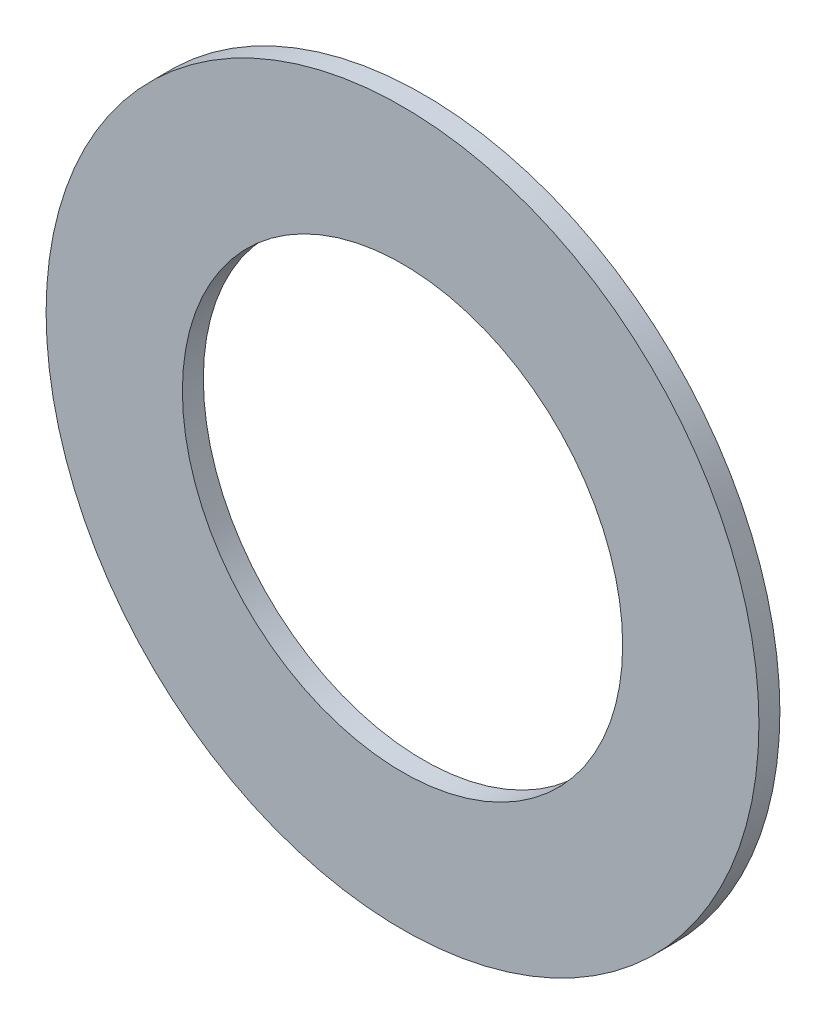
ISO-10303-21;
HEADER;
FILE_DESCRIPTION(('STEP AP214'),'2;1');
FILE_NAME('part.step','',(''),(''),'','','');
FILE_SCHEMA(('AUTOMOTIVE_DESIGN { 1 0 10303 214 1 1 1 1 }'));
ENDSEC;
DATA;
#1=APPLICATION_CONTEXT('core data for automotive mechanical design processes');
#2=APPLICATION_PROTOCOL_DEFINITION('international standard','automotive_design',2000,#1);
#3=PRODUCT_CONTEXT('',#1,'mechanical');
#4=PRODUCT('Part','Part','',(#3));
#5=PRODUCT_RELATED_PRODUCT_CATEGORY('part','',(#4));
#6=PRODUCT_DEFINITION_FORMATION('','',#4);
#7=PRODUCT_DEFINITION_CONTEXT('part definition',#1,'design');
#8=PRODUCT_DEFINITION('design','',#6,#7);
#9=PRODUCT_DEFINITION_SHAPE('','',#8);
#10=(LENGTH_UNIT() NAMED_UNIT(*) SI_UNIT(.MILLI.,.METRE.));
#11=(NAMED_UNIT(*) PLANE_ANGLE_UNIT() SI_UNIT($,.RADIAN.));
#12=(NAMED_UNIT(*) SI_UNIT($,.STERADIAN.) SOLID_ANGLE_UNIT());
#13=UNCERTAINTY_MEASURE_WITH_UNIT(LENGTH_MEASURE(1.E-05),#10,'distance_accuracy_value','');
#14=(GEOMETRIC_REPRESENTATION_CONTEXT(3) GLOBAL_UNCERTAINTY_ASSIGNED_CONTEXT((#13)) GLOBAL_UNIT_ASSIGNED_CONTEXT((#10,
#11,#12)) REPRESENTATION_CONTEXT('',''));
#15=CARTESIAN_POINT('',(0.,0.,0.));
#16=DIRECTION('',(0.,0.,1.));
#17=DIRECTION('',(1.,0.,0.));
#18=AXIS2_PLACEMENT_3D('',#15,#16,#17);
#19=CARTESIAN_POINT('',(0.,0.,1.));
#20=DIRECTION('',(0.,0.,1.));
#21=DIRECTION('',(1.,0.,0.));
#22=AXIS2_PLACEMENT_3D('',#19,#20,#21);
#23=PLANE('',#22);
#24=CARTESIAN_POINT('',(0.,0.,1.));
#25=DIRECTION('',(0.,0.,1.));
#26=DIRECTION('',(1.,0.,0.));
#27=AXIS2_PLACEMENT_3D('',#24,#25,#26);
#28=CIRCLE('',#27,17.);
#29=CARTESIAN_POINT('',(17.,0.,1.));
#30=VERTEX_POINT('',#29);
#31=EDGE_CURVE('E10',#30,#30,#28,.T.);
#32=ORIENTED_EDGE('',*,*,#31,.T.);
#33=EDGE_LOOP('',(#32));
#34=FACE_BOUND('',#33,.T.);
#35=CARTESIAN_POINT('',(0.,0.,1.));
#36=DIRECTION('',(0.,0.,1.));
#37=DIRECTION('',(1.,0.,0.));
#38=AXIS2_PLACEMENT_3D('',#35,#36,#37);
#39=CIRCLE('',#38,10.5);
#40=CARTESIAN_POINT('',(10.5,0.,1.));
#41=VERTEX_POINT('',#40);
#42=EDGE_CURVE('E33',#41,#41,#39,.T.);
#43=ORIENTED_EDGE('',*,*,#42,.F.);
#44=EDGE_LOOP('',(#43));
#45=FACE_BOUND('',#44,.T.);
#46=ADVANCED_FACE('F22',(#34,#45),#23,.T.);
#47=CARTESIAN_POINT('',(0.,0.,0.));
#48=DIRECTION('',(0.,0.,1.));
#49=DIRECTION('',(1.,0.,0.));
#50=AXIS2_PLACEMENT_3D('',#47,#48,#49);
#51=PLANE('',#50);
#52=CARTESIAN_POINT('',(0.,0.,0.));
#53=DIRECTION('',(0.,0.,1.));
#54=DIRECTION('',(1.,0.,0.));
#55=AXIS2_PLACEMENT_3D('',#52,#53,#54);
#56=CIRCLE('',#55,17.);
#57=CARTESIAN_POINT('',(17.,0.,0.));
#58=VERTEX_POINT('',#57);
#59=EDGE_CURVE('E29',#58,#58,#56,.T.);
#60=ORIENTED_EDGE('',*,*,#59,.F.);
#61=EDGE_LOOP('',(#60));
#62=FACE_BOUND('',#61,.T.);
#63=CARTESIAN_POINT('',(0.,0.,0.));
#64=DIRECTION('',(0.,0.,1.));
#65=DIRECTION('',(1.,0.,0.));
#66=AXIS2_PLACEMENT_3D('',#63,#64,#65);
#67=CIRCLE('',#66,10.5);
#68=CARTESIAN_POINT('',(10.5,0.,0.));
#69=VERTEX_POINT('',#68);
#70=EDGE_CURVE('E37',#69,#69,#67,.T.);
#71=ORIENTED_EDGE('',*,*,#70,.T.);
#72=EDGE_LOOP('',(#71));
#73=FACE_BOUND('',#72,.T.);
#74=ADVANCED_FACE('F43',(#62,#73),#51,.F.);
#75=CARTESIAN_POINT('',(0.,0.,1.));
#76=DIRECTION('',(0.,0.,-1.));
#77=DIRECTION('',(-1.,0.,0.));
#78=AXIS2_PLACEMENT_3D('',#75,#76,#77);
#79=CYLINDRICAL_SURFACE('',#78,17.);
#80=ORIENTED_EDGE('',*,*,#31,.F.);
#81=EDGE_LOOP('',(#80));
#82=FACE_BOUND('',#81,.T.);
#83=ORIENTED_EDGE('',*,*,#59,.T.);
#84=EDGE_LOOP('',(#83));
#85=FACE_BOUND('',#84,.T.);
#86=ADVANCED_FACE('F24',(#82,#85),#79,.T.);
#87=CARTESIAN_POINT('',(0.,0.,1.));
#88=DIRECTION('',(0.,0.,-1.));
#89=DIRECTION('',(-1.,0.,0.));
#90=AXIS2_PLACEMENT_3D('',#87,#88,#89);
#91=CYLINDRICAL_SURFACE('',#90,10.5);
#92=ORIENTED_EDGE('',*,*,#42,.T.);
#93=EDGE_LOOP('',(#92));
#94=FACE_BOUND('',#93,.T.);
#95=ORIENTED_EDGE('',*,*,#70,.F.);
#96=EDGE_LOOP('',(#95));
#97=FACE_BOUND('',#96,.T.);
#98=ADVANCED_FACE('F45',(#94,#97),#91,.F.);
#99=CLOSED_SHELL('',(#46,#74,#86,#98));
#100=MANIFOLD_SOLID_BREP('B2',#99);
#101=ADVANCED_BREP_SHAPE_REPRESENTATION('',(#18,#100),#14);
#102=SHAPE_DEFINITION_REPRESENTATION(#9,#101);
ENDSEC;
END-ISO-10303-21;
